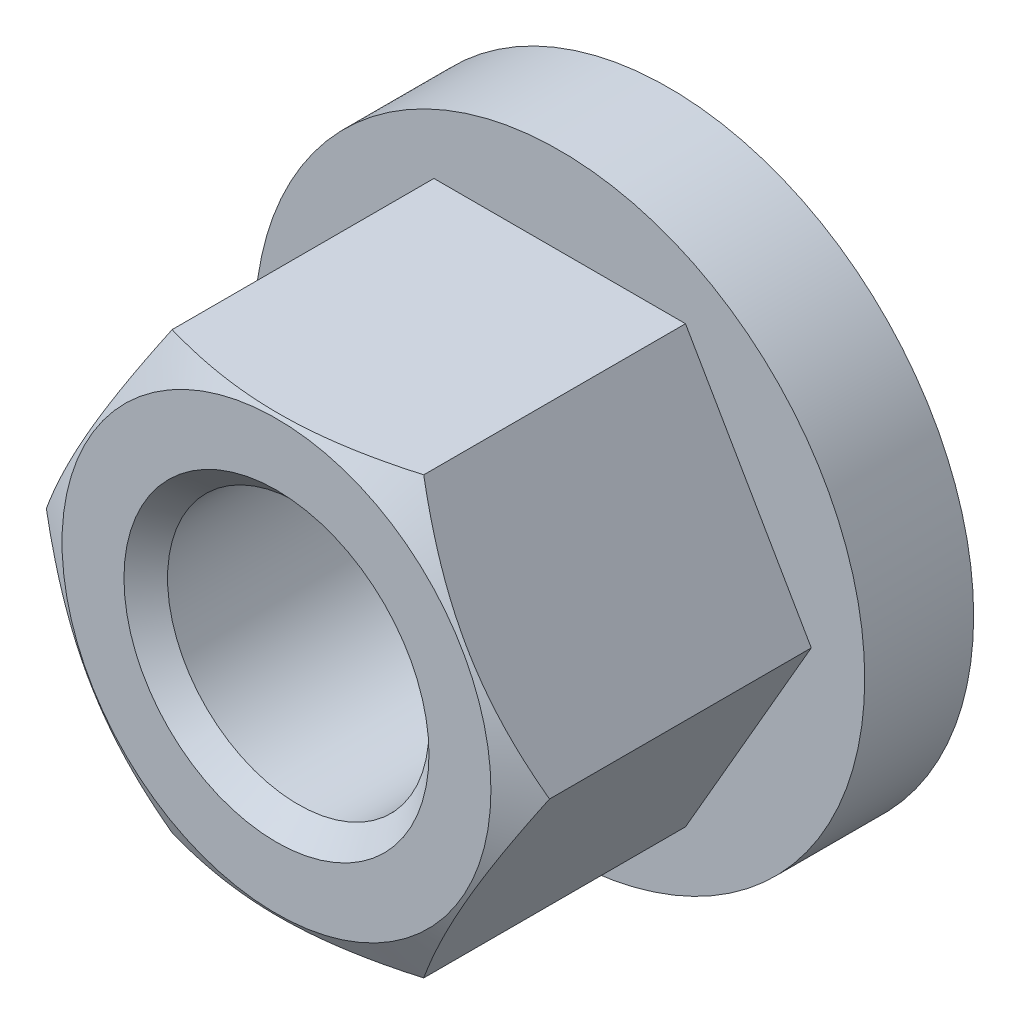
from build123d import *

# Parameters (mm, degrees)
ESQUISSE1_R             = 7
BASE_EXTRUSION_DEPTH    = 9
CHANFREIN1_SIZE         = 1.2
CHANFREIN1_SIZE2        = 2.078460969
ESQUISSE2_OUTSIDE_W     = 20.35
ESQUISSE2_OUTSIDE_H     = 20.35
ENL_V_MAT_EXTRU_2_DEPTH = 14.37908816
ESQUISSE3_R             = 7
BOSS_EXTRU_1_DEPTH      = 2.5
ESQUISSE4_R             = 3
ENL_V_MAT_EXTRU_5_DEPTH = 14.37908816
CHANFREIN2_SIZE         = 0.5


with BuildPart() as part:
    # Esquisse1 → Base-Extrusion (new body)
    with BuildSketch(Plane.XY):
        Circle(ESQUISSE1_R)
    extrude(amount=BASE_EXTRUSION_DEPTH)

    # Chanfrein1
    chanfrein1_edges = [part.edges().sort_by_distance(p)[0] for p in [
        (-7, 0, 9),
    ]]
    chanfrein1_side = [part.faces().sort_by_distance(p)[0] for p in [
        (-7, 0, 4.5),
    ]]
    chamfer(chanfrein1_edges, length=CHANFREIN1_SIZE, length2=CHANFREIN1_SIZE2, reference=chanfrein1_side[0])

    # Esquisse2 outside → Enl_v. mat.-Extru.2 (cut, through all)
    with BuildSketch(Plane.XY):
        Rectangle(ESQUISSE2_OUTSIDE_W, ESQUISSE2_OUTSIDE_H)
        Polygon((2.886751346, -5), (5.773502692, 0), (2.886751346, 5), (-2.886751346, 5), (-5.773502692, 0), (-2.886751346, -5), align=None, mode=Mode.SUBTRACT)
    extrude(amount=ENL_V_MAT_EXTRU_2_DEPTH, mode=Mode.SUBTRACT)

    # Esquisse3 → Boss.-Extru.1 (add)
    with BuildSketch(Plane.XY):
        Circle(ESQUISSE3_R)
    extrude(amount=BOSS_EXTRU_1_DEPTH)

    # Esquisse4 → Enl_v. mat.-Extru.5 (cut, through all)
    with BuildSketch(Plane.XY):
        Circle(ESQUISSE4_R)
    extrude(amount=ENL_V_MAT_EXTRU_5_DEPTH, mode=Mode.SUBTRACT)

    # Chanfrein2
    chanfrein2_edges = [part.edges().sort_by_distance(p)[0] for p in [
        (-3, 0, 0),
        (-3, 0, 9),
    ]]
    chamfer(chanfrein2_edges, length=CHANFREIN2_SIZE)


solid = part.part
